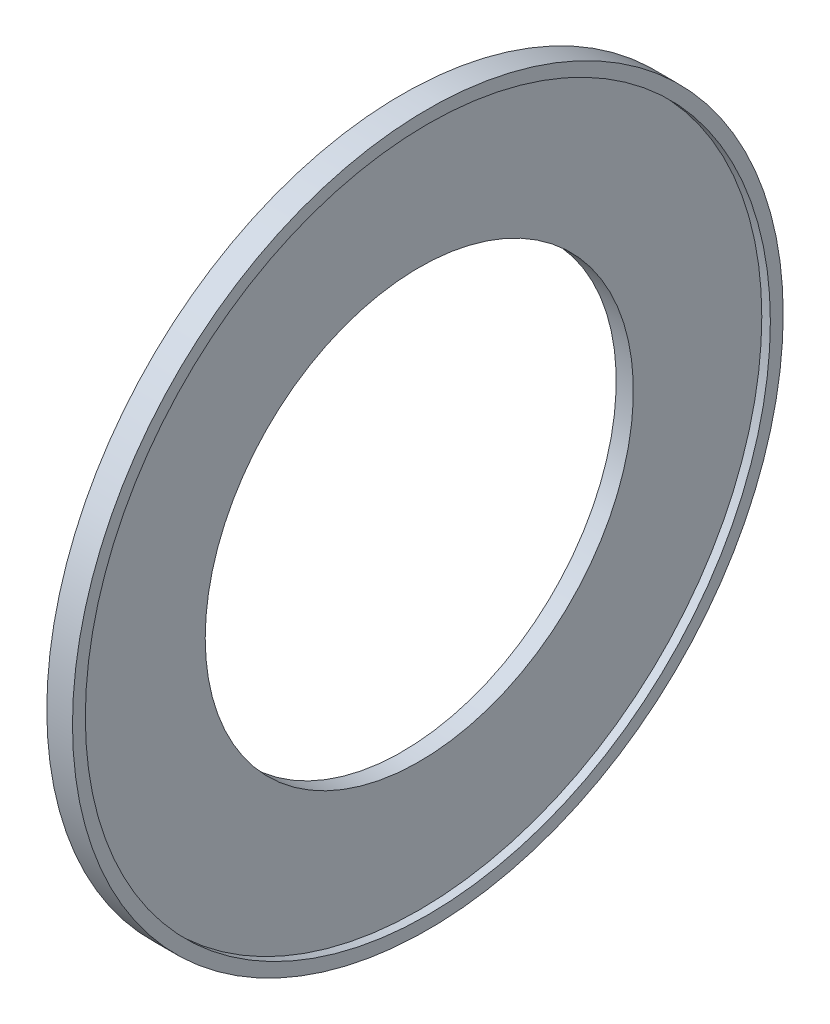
from build123d import *


with BuildPart() as part:
    # Esquisse1 → base (revolve)
    with BuildSketch(Plane.XY, mode=Mode.PRIVATE) as base_sk:
        Polygon((0, 12.5), (0, 20.75), (1.5, 20.75), (1.5, 20), (1, 20), (1, 12.5), align=None)
    revolve(base_sk.sketch.rotate(Axis((-11, 0, 0), (1, 0, 0)), 90), axis=Axis((-11, 0, 0), (1, 0, 0)))


solid = part.part
